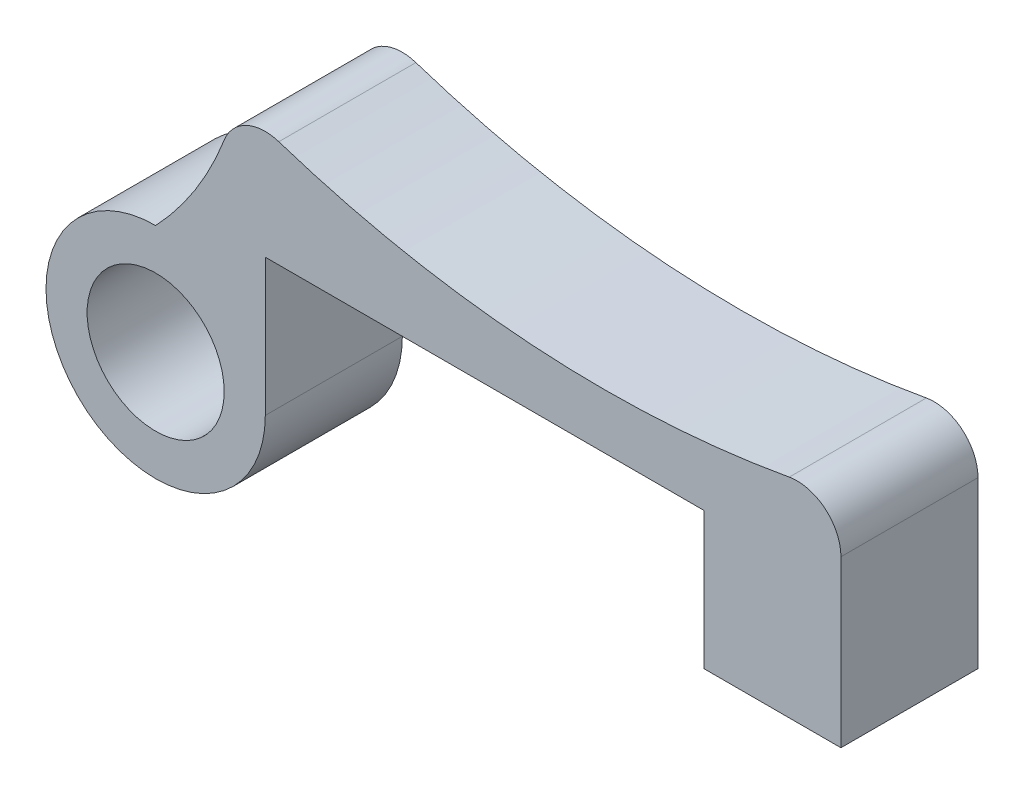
from build123d import *

# Parameters (mm, degrees)
SKETCH1_R           = 2.54
SKETCH1_R_2         = 1.5875
BOSS_EXTRUDE1_DEPTH = 3.175
FILLET1_R           = 1.016
FILLET2_R           = 1.016


with BuildPart() as part:
    # Sketch1 → Boss-Extrude1 (new body)
    # profile 1 of 2: a face of its own
    with BuildSketch(Plane.XY):
        with BuildLine():
            ThreePointArc((0, 2.54), (1.796051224, 1.796051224), (2.54, 0))
            Line((2.54, 0), (2.54, 3.175))
            Line((2.54, 3.175), (12.7, 3.175))
            Line((12.7, 3.175), (12.7, 0))
            Line((12.7, 0), (15.875, 0))
            Line((15.875, 0), (15.875, 5.08))
            ThreePointArc((15.875, 5.08), (8.811770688, 4.495737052), (1.883462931, 5.988761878))
            ThreePointArc((1.883462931, 5.988761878), (1.16786594, 4.140882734), (0, 2.54))
        make_face()
    # profile 2 of 2: a face of its own
    with BuildSketch(Plane.XY):
        Circle(SKETCH1_R)
        Circle(SKETCH1_R_2, mode=Mode.SUBTRACT)
    extrude(amount=BOSS_EXTRUDE1_DEPTH)

    # Fillet1
    fillet1_edges = [part.edges().sort_by_distance(p)[0] for p in [
        (1.883462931, 5.988761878, 1.5875),
    ]]
    fillet(fillet1_edges, radius=FILLET1_R)

    # Fillet2
    fillet2_edges = [part.edges().sort_by_distance(p)[0] for p in [
        (15.875, 5.08, 1.5875),
    ]]
    fillet(fillet2_edges, radius=FILLET2_R)


solid = part.part
